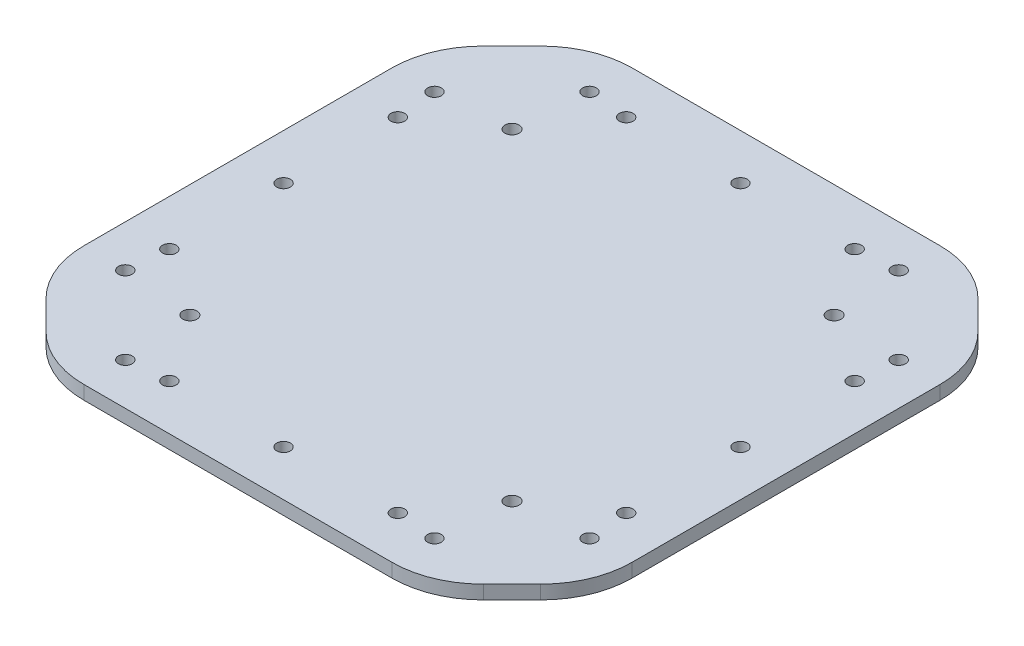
from build123d import *

# Parameters (mm, degrees)
SKETCH_1_R      = 1.5
SKETCH_1_R_2    = 1.555791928
EXTRUDE_1_DEPTH = 3
FILLET_1_R      = 20


with BuildPart() as part:
    # Sketch 1 → Extrude 1 (new body)
    with BuildSketch(Plane(origin=(0, 0, 0), x_dir=(1, 0, 0), z_dir=(0, 1, 0))):
        Polygon((42, 60), (-42, 60), (-60, 42), (-60, -42), (-42, -60), (42, -60), (60, -42), (60, 42), align=None)
        with Locations(Location((-33.837049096, -50.807611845, 0), (0, 0, 270))):
            Circle(SKETCH_1_R, mode=Mode.SUBTRACT)
        with Locations(Location((-50.807611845, -33.837049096, 0), (0, 0, 270))):
            Circle(SKETCH_1_R, mode=Mode.SUBTRACT)
        with Locations(Location((-35.251262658, -35.251262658, 0), (0, 0, 270))):
            Circle(SKETCH_1_R_2, mode=Mode.SUBTRACT)
        with Locations(Location((-25, -50, 0), (0, 0, 270))):
            Circle(SKETCH_1_R, mode=Mode.SUBTRACT)
        with Locations(Location((-50, -25, 0), (0, 0, 270))):
            Circle(SKETCH_1_R, mode=Mode.SUBTRACT)
        with Locations(Location((0, -50, 0), (0, 0, 270))):
            Circle(SKETCH_1_R, mode=Mode.SUBTRACT)
        with Locations(Location((25, -50, 0), (0, 0, 270))):
            Circle(SKETCH_1_R, mode=Mode.SUBTRACT)
        with Locations(Location((33.837049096, -50.807611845, 0), (0, 0, 270))):
            Circle(SKETCH_1_R, mode=Mode.SUBTRACT)
        with Locations(Location((35.251262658, -35.251262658, 0), (0, 0, 270))):
            Circle(SKETCH_1_R_2, mode=Mode.SUBTRACT)
        with Locations(Location((50.807611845, -33.837049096, 0), (0, 0, 270))):
            Circle(SKETCH_1_R, mode=Mode.SUBTRACT)
        with Locations(Location((50, -25, 0), (0, 0, 270))):
            Circle(SKETCH_1_R, mode=Mode.SUBTRACT)
        with Locations(Location((-50, 0, 0), (0, 0, 270))):
            Circle(SKETCH_1_R, mode=Mode.SUBTRACT)
        with Locations(Location((-50, 25, 0), (0, 0, 270))):
            Circle(SKETCH_1_R, mode=Mode.SUBTRACT)
        with Locations(Location((-50.807611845, 33.837049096, 0), (0, 0, 270))):
            Circle(SKETCH_1_R, mode=Mode.SUBTRACT)
        with Locations(Location((-35.251262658, 35.251262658, 0), (0, 0, 270))):
            Circle(SKETCH_1_R_2, mode=Mode.SUBTRACT)
        with Locations(Location((-33.837049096, 50.807611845, 0), (0, 0, 270))):
            Circle(SKETCH_1_R, mode=Mode.SUBTRACT)
        with Locations(Location((-25, 50, 0), (0, 0, 270))):
            Circle(SKETCH_1_R, mode=Mode.SUBTRACT)
        with Locations(Location((0, 50, 0), (0, 0, 270))):
            Circle(SKETCH_1_R, mode=Mode.SUBTRACT)
        with Locations(Location((50, 0, 0), (0, 0, 270))):
            Circle(SKETCH_1_R, mode=Mode.SUBTRACT)
        with Locations(Location((50, 25, 0), (0, 0, 270))):
            Circle(SKETCH_1_R, mode=Mode.SUBTRACT)
        with Locations(Location((25, 50, 0), (0, 0, 270))):
            Circle(SKETCH_1_R, mode=Mode.SUBTRACT)
        with Locations(Location((35.251262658, 35.251262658, 0), (0, 0, 270))):
            Circle(SKETCH_1_R_2, mode=Mode.SUBTRACT)
        with Locations(Location((50.807611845, 33.837049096, 0), (0, 0, 270))):
            Circle(SKETCH_1_R, mode=Mode.SUBTRACT)
        with Locations(Location((33.837049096, 50.807611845, 0), (0, 0, 270))):
            Circle(SKETCH_1_R, mode=Mode.SUBTRACT)
    extrude(amount=EXTRUDE_1_DEPTH)

    # Fillet 1
    fillet_1_edges = [part.edges().sort_by_distance(p)[0] for p in [
        (-60, 1.5, 42),
        (-60, 1.5, -42),
        (-42, 1.5, -60),
        (42, 1.5, -60),
        (60, 1.5, -42),
        (60, 1.5, 42),
        (42, 1.5, 60),
        (-42, 1.5, 60),
    ]]
    fillet(fillet_1_edges, radius=FILLET_1_R)


solid = part.part
